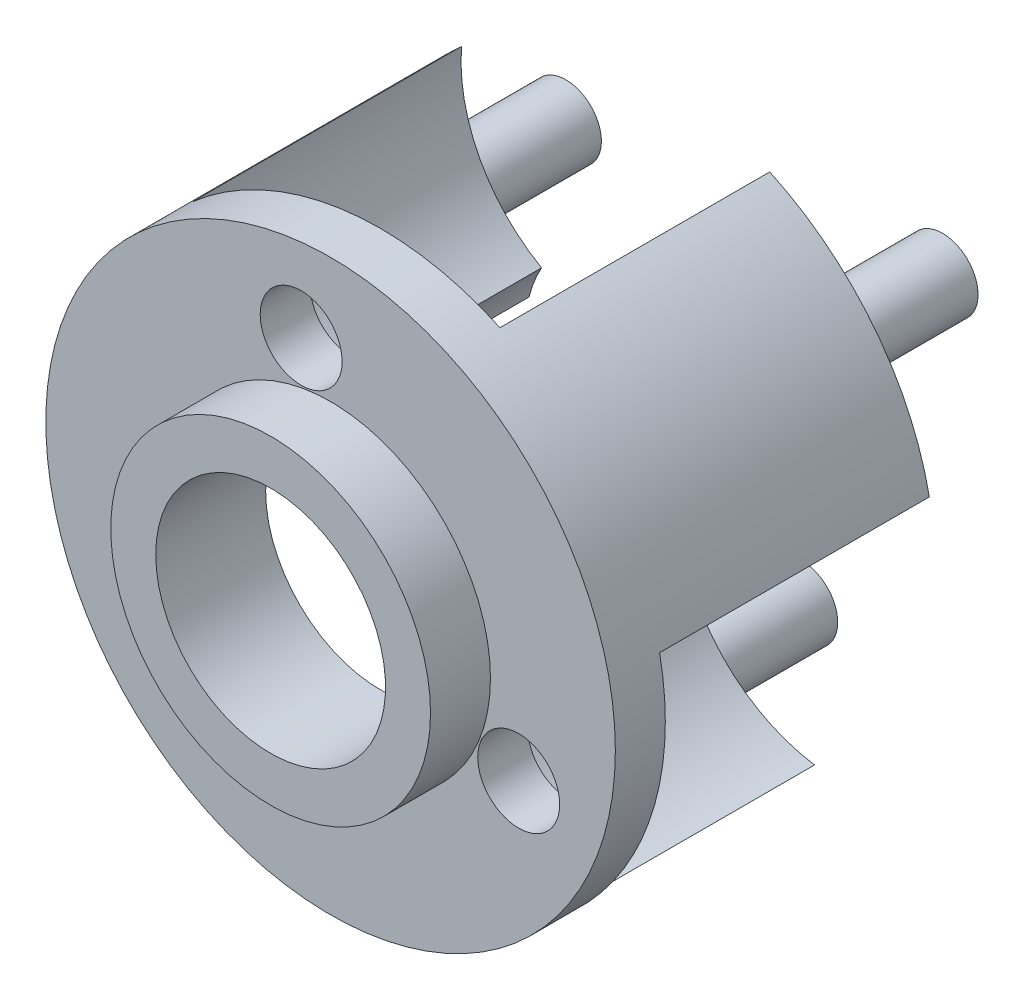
from build123d import *

# Parameters (mm, degrees)
ESQUISSE1_W                     = 2.85
ESQUISSE1_H                     = 3.2
ENL_V_MAT_EXTRU_1_DEPTH         = 2.7
BOSS_EXTRU_1_START              = 2.7
BOSS_EXTRU_1_DEPTH              = 2.7
BOSS_EXTRU_2_START              = 2.7
BOSS_EXTRU_2_DEPTH              = 2.7
ESQUISSE5_R                     = 1.6
BOSS_EXTRU_3_DEPTH              = 0.6
ESQUISSE6_W                     = 0.355
ESQUISSE6_H                     = 1.2
ESQUISSE7_W                     = 0.355
ESQUISSE7_H                     = 1.2
ESQUISSE8_W                     = 0.355
ESQUISSE8_H                     = 1.2
PER_AGE1_D                      = 0.82
PER_AGE1_DEPTH                  = 1.1
DIAM_TRE_DU_PER_AGE_2_3_2_3_1_D = 2.3


with BuildPart() as part:
    # Esquisse1 → R_volution1 (revolve)
    with BuildSketch(Plane(origin=(0, 0, 0), x_dir=(1, 0, 0), z_dir=(0, 1, 0))):
        with Locations((1.425, -5.25)):
            Rectangle(ESQUISSE1_W, ESQUISSE1_H)
    revolve(axis=Axis((0, 0, 3.65), (0, 0, 1)))

    # Esquisse2 → Enl_v. mat.-Extru.1 (cut)
    with BuildSketch(Plane(origin=(0, 0, 3.65), x_dir=(-1, 0, 0), z_dir=(0, 0, -1))):
        with BuildLine():
            ThreePointArc((-1.194903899, 2.587412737), (-1.275598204, 1.696671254), (-0.865610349, 0.901786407))
            ThreePointArc((-0.865610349, 0.901786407), (-0.980042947, 0.775896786), (-1.07632169, 0.635634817))
            ThreePointArc((-1.07632169, 0.635634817), (-1.944064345, 0.852325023), (-2.792534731, 0.569429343))
            ThreePointArc((-2.792534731, 0.569429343), (2.234497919, -1.769044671), (-1.194903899, 2.587412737))
        make_face()
    extrude(amount=-ENL_V_MAT_EXTRU_1_DEPTH, mode=Mode.SUBTRACT)

    # Esquisse3 → Boss.-Extru.1 (add)
    with BuildSketch(Plane(origin=(0, 0, 6.35), x_dir=(-1, 0, 0), z_dir=(0, 0, -1)).offset(BOSS_EXTRU_1_START)):
        with BuildLine():
            ThreePointArc((1.213775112, 0.298747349), (1.161967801, 0.460793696), (1.088636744, 0.614304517))
            ThreePointArc((1.088636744, 0.614304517), (1.710167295, 1.257446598), (1.889407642, 2.133691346))
            ThreePointArc((1.889407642, 2.133691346), (2.649286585, 1.050609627), (2.83821711, -0.258889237))
            ThreePointArc((2.83821711, -0.258889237), (2.10715951, 0.256364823), (1.213775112, 0.298747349))
        make_face()
    extrude(amount=-BOSS_EXTRU_1_DEPTH)

    # Esquisse4 → Boss.-Extru.2 (add)
    with BuildSketch(Plane(origin=(0, 0, 6.35), x_dir=(-1, 0, 0), z_dir=(0, 0, -1)).offset(BOSS_EXTRU_2_START)):
        with BuildLine():
            ThreePointArc((-0.348164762, -1.200533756), (-0.181924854, -1.236690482), (-0.012315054, -1.249939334))
            ThreePointArc((-0.012315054, -1.249939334), (0.23389705, -2.109771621), (0.903127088, -2.70312069))
            ThreePointArc((0.903127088, -2.70312069), (-0.414788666, -2.819654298), (-1.643313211, -2.3285235))
            ThreePointArc((-1.643313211, -2.3285235), (-0.831561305, -1.953036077), (-0.348164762, -1.200533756))
        make_face()
    extrude(amount=-BOSS_EXTRU_2_DEPTH)

    # Esquisse5 → Boss.-Extru.3 (add)
    with BuildSketch(Plane.XY.offset(6.85)):
        Circle(ESQUISSE5_R)
    extrude(amount=BOSS_EXTRU_3_DEPTH)

    # Esquisse6 → R_volution2 (revolve)
    with BuildSketch(Plane.XZ.offset(2.176575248), mode=Mode.PRIVATE) as r_volution2_sk:
        with Locations((0.497687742, 3.05)):
            Rectangle(ESQUISSE6_W, ESQUISSE6_H)
    revolve(r_volution2_sk.sketch.rotate(Axis((0.320187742, -2.176575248, 3.65), (0, 0, -1)), 180), axis=Axis((0.320187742, -2.176575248, 3.65), (0, 0, -1)))

    # Esquisse7 → R_volution3 (revolve)
    with BuildSketch(Plane.XZ.offset(-0.810996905), mode=Mode.PRIVATE) as r_volution3_sk:
        with Locations((-1.867563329, 3.05)):
            Rectangle(ESQUISSE7_W, ESQUISSE7_H)
    revolve(r_volution3_sk.sketch.rotate(Axis((-2.045063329, 0.810996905, 3.65), (0, 0, -1)), 180), axis=Axis((-2.045063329, 0.810996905, 3.65), (0, 0, -1)))

    # Esquisse8 → R_volution4 (revolve)
    with BuildSketch(Plane.XZ.offset(-1.365578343), mode=Mode.PRIVATE) as r_volution4_sk:
        with Locations((1.902375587, 3.05)):
            Rectangle(ESQUISSE8_W, ESQUISSE8_H)
    revolve(r_volution4_sk.sketch.rotate(Axis((1.724875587, 1.365578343, 3.65), (0, 0, -1)), 180), axis=Axis((1.724875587, 1.365578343, 3.65), (0, 0, -1)))

    # Per_age1
    with Locations(Plane(origin=(0, 0, 6.35), x_dir=(-1, 0, 0), z_dir=(0, 0, -1))):
        with Locations((1.587669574, -1.256952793), (0.294718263, 2.00343858), (-1.882387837, -0.746485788)):
            Hole(PER_AGE1_D / 2, depth=PER_AGE1_DEPTH)

    # Diam_tre du per_age _2.3 _2.3_1 (through all)
    with Locations(Plane(origin=(0, 0, 6.35), x_dir=(-1, 0, 0), z_dir=(0, 0, -1))):
        with Locations((0, 0)):
            Hole(DIAM_TRE_DU_PER_AGE_2_3_2_3_1_D / 2)


solid = part.part
